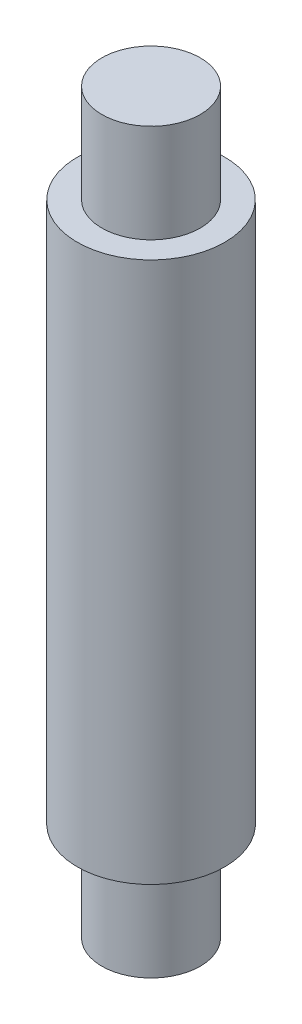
from build123d import *


with BuildPart() as part:
    # Sketch1 → Revolve1 (revolve)
    with BuildSketch(Plane.XY):
        Polygon((-75, 0), (-65, 0), (-65, 20), (-60, 20), (-60, 130), (-65, 130), (-65, 150), (-75, 150), align=None)
    revolve(axis=Axis((-75, 0, 0), (0, 1, 0)))


solid = part.part
